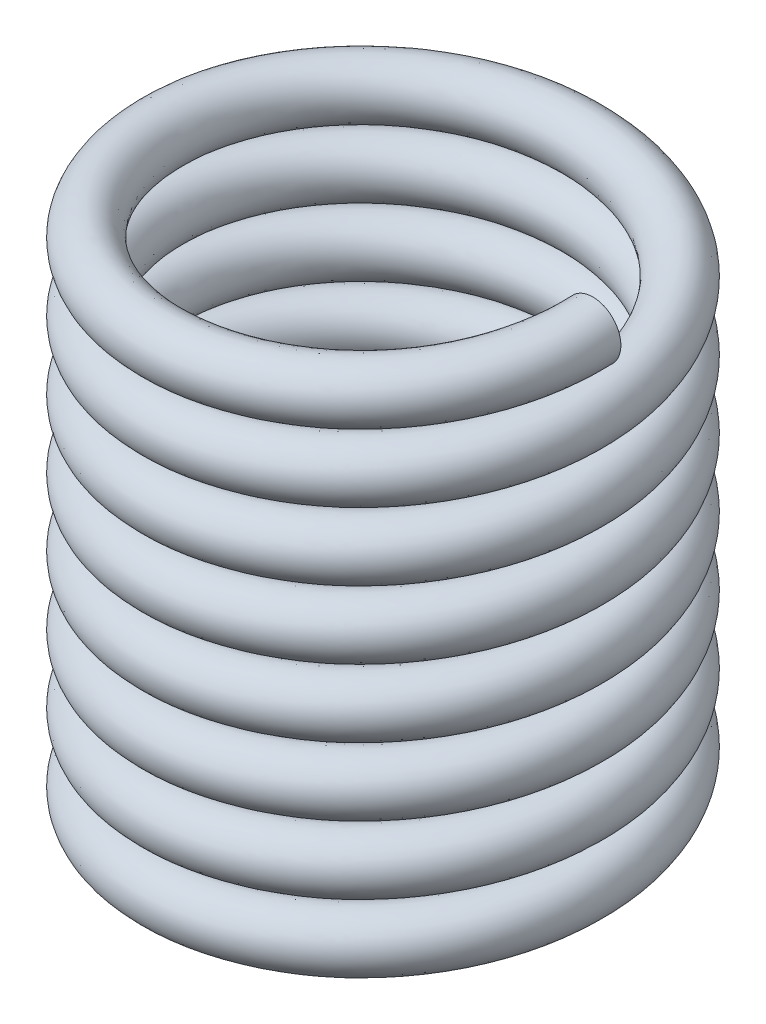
ISO-10303-21;
HEADER;
FILE_DESCRIPTION(('STEP AP214'),'2;1');
FILE_NAME('part.step','',(''),(''),'','','');
FILE_SCHEMA(('AUTOMOTIVE_DESIGN { 1 0 10303 214 1 1 1 1 }'));
ENDSEC;
DATA;
#1=APPLICATION_CONTEXT('core data for automotive mechanical design processes');
#2=APPLICATION_PROTOCOL_DEFINITION('international standard','automotive_design',2000,#1);
#3=PRODUCT_CONTEXT('',#1,'mechanical');
#4=PRODUCT('Part','Part','',(#3));
#5=PRODUCT_RELATED_PRODUCT_CATEGORY('part','',(#4));
#6=PRODUCT_DEFINITION_FORMATION('','',#4);
#7=PRODUCT_DEFINITION_CONTEXT('part definition',#1,'design');
#8=PRODUCT_DEFINITION('design','',#6,#7);
#9=PRODUCT_DEFINITION_SHAPE('','',#8);
#10=(LENGTH_UNIT() NAMED_UNIT(*) SI_UNIT(.MILLI.,.METRE.));
#11=(NAMED_UNIT(*) PLANE_ANGLE_UNIT() SI_UNIT($,.RADIAN.));
#12=(NAMED_UNIT(*) SI_UNIT($,.STERADIAN.) SOLID_ANGLE_UNIT());
#13=UNCERTAINTY_MEASURE_WITH_UNIT(LENGTH_MEASURE(1.E-05),#10,'distance_accuracy_value','');
#14=(GEOMETRIC_REPRESENTATION_CONTEXT(3) GLOBAL_UNCERTAINTY_ASSIGNED_CONTEXT((#13)) GLOBAL_UNIT_ASSIGNED_CONTEXT((#10,
#11,#12)) REPRESENTATION_CONTEXT('',''));
#15=CARTESIAN_POINT('',(0.,0.,0.));
#16=DIRECTION('',(0.,0.,1.));
#17=DIRECTION('',(1.,0.,0.));
#18=AXIS2_PLACEMENT_3D('',#15,#16,#17);
#19=CARTESIAN_POINT('',(-7.5,0.,0.));
#20=DIRECTION('',(0.,0.,1.));
#21=DIRECTION('',(1.,0.,0.));
#22=AXIS2_PLACEMENT_3D('',#19,#20,#21);
#23=PLANE('',#22);
#24=CARTESIAN_POINT('',(-7.5,0.,0.));
#25=DIRECTION('',(0.,0.,1.));
#26=DIRECTION('',(1.,0.,0.));
#27=AXIS2_PLACEMENT_3D('',#24,#25,#26);
#28=CIRCLE('',#27,1.);
#29=CARTESIAN_POINT('',(-6.5,0.,0.));
#30=VERTEX_POINT('',#29);
#31=EDGE_CURVE('E49',#30,#30,#28,.T.);
#32=ORIENTED_EDGE('',*,*,#31,.F.);
#33=EDGE_LOOP('',(#32));
#34=FACE_BOUND('',#33,.T.);
#35=ADVANCED_FACE('F43',(#34),#23,.F.);
#36=CARTESIAN_POINT('',(7.5,18.1926992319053,-8.12228653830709E-13));
#37=DIRECTION('',(-1.08297153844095E-13,0.,-1.));
#38=DIRECTION('',(-1.,0.,1.08297153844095E-13));
#39=AXIS2_PLACEMENT_3D('',#36,#37,#38);
#40=PLANE('',#39);
#41=CARTESIAN_POINT('',(7.5,18.1926992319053,-8.12228653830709E-13));
#42=DIRECTION('',(-1.08297153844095E-13,0.,-1.));
#43=DIRECTION('',(-1.,0.,1.08297153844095E-13));
#44=AXIS2_PLACEMENT_3D('',#41,#42,#43);
#45=CIRCLE('',#44,1.);
#46=CARTESIAN_POINT('',(6.5,18.1926992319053,-7.03931499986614E-13));
#47=VERTEX_POINT('',#46);
#48=EDGE_CURVE('E10',#47,#47,#45,.T.);
#49=ORIENTED_EDGE('',*,*,#48,.T.);
#50=EDGE_LOOP('',(#49));
#51=FACE_BOUND('',#50,.T.);
#52=ADVANCED_FACE('F58',(#51),#40,.T.);
#53=CARTESIAN_POINT('',(-6.5,0.,0.));
#54=CARTESIAN_POINT('',(-6.5,0.202141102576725,3.75277674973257));
#55=CARTESIAN_POINT('',(-3.25,0.404282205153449,5.62916512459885));
#56=CARTESIAN_POINT('',(0.,0.606423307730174,7.50555349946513));
#57=CARTESIAN_POINT('',(3.25,0.808564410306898,5.62916512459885));
#58=CARTESIAN_POINT('',(6.5,1.01070551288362,3.75277674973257));
#59=CARTESIAN_POINT('',(6.5,1.21284661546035,0.));
#60=CARTESIAN_POINT('',(6.5,1.41498771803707,-3.75277674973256));
#61=CARTESIAN_POINT('',(3.25,1.6171288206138,-5.62916512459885));
#62=CARTESIAN_POINT('',(0.,1.81926992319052,-7.50555349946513));
#63=CARTESIAN_POINT('',(-3.25,2.02141102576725,-5.62916512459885));
#64=CARTESIAN_POINT('',(-6.5,2.22355212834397,-3.75277674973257));
#65=CARTESIAN_POINT('',(-6.5,2.42569323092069,0.));
#66=CARTESIAN_POINT('',(-6.5,2.62783433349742,3.75277674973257));
#67=CARTESIAN_POINT('',(-3.25,2.82997543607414,5.62916512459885));
#68=CARTESIAN_POINT('',(0.,3.03211653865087,7.50555349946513));
#69=CARTESIAN_POINT('',(3.25,3.23425764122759,5.62916512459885));
#70=CARTESIAN_POINT('',(6.5,3.43639874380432,3.75277674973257));
#71=CARTESIAN_POINT('',(6.5,3.63853984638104,0.));
#72=CARTESIAN_POINT('',(6.5,3.84068094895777,-3.75277674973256));
#73=CARTESIAN_POINT('',(3.25,4.04282205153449,-5.62916512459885));
#74=CARTESIAN_POINT('',(0.,4.24496315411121,-7.50555349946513));
#75=CARTESIAN_POINT('',(-3.25,4.44710425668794,-5.62916512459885));
#76=CARTESIAN_POINT('',(-6.5,4.64924535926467,-3.75277674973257));
#77=CARTESIAN_POINT('',(-6.5,4.85138646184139,0.));
#78=CARTESIAN_POINT('',(-6.5,5.05352756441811,3.75277674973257));
#79=CARTESIAN_POINT('',(-3.25,5.25566866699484,5.62916512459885));
#80=CARTESIAN_POINT('',(0.,5.45780976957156,7.50555349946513));
#81=CARTESIAN_POINT('',(3.25,5.65995087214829,5.62916512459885));
#82=CARTESIAN_POINT('',(6.5,5.86209197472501,3.75277674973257));
#83=CARTESIAN_POINT('',(6.5,6.06423307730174,0.));
#84=CARTESIAN_POINT('',(6.5,6.26637417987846,-3.75277674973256));
#85=CARTESIAN_POINT('',(3.25,6.46851528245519,-5.62916512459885));
#86=CARTESIAN_POINT('',(0.,6.67065638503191,-7.50555349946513));
#87=CARTESIAN_POINT('',(-3.25,6.87279748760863,-5.62916512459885));
#88=CARTESIAN_POINT('',(-6.5,7.07493859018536,-3.75277674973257));
#89=CARTESIAN_POINT('',(-6.5,7.27707969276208,0.));
#90=CARTESIAN_POINT('',(-6.5,7.47922079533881,3.75277674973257));
#91=CARTESIAN_POINT('',(-3.25,7.68136189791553,5.62916512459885));
#92=CARTESIAN_POINT('',(0.,7.88350300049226,7.50555349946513));
#93=CARTESIAN_POINT('',(3.25,8.08564410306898,5.62916512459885));
#94=CARTESIAN_POINT('',(6.5,8.28778520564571,3.75277674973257));
#95=CARTESIAN_POINT('',(6.5,8.48992630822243,0.));
#96=CARTESIAN_POINT('',(6.5,8.69206741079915,-3.75277674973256));
#97=CARTESIAN_POINT('',(3.25,8.89420851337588,-5.62916512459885));
#98=CARTESIAN_POINT('',(0.,9.0963496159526,-7.50555349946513));
#99=CARTESIAN_POINT('',(-3.25,9.29849071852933,-5.62916512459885));
#100=CARTESIAN_POINT('',(-6.5,9.50063182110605,-3.75277674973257));
#101=CARTESIAN_POINT('',(-6.5,9.70277292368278,0.));
#102=CARTESIAN_POINT('',(-6.5,9.9049140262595,3.75277674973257));
#103=CARTESIAN_POINT('',(-3.25,10.1070551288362,5.62916512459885));
#104=CARTESIAN_POINT('',(0.,10.309196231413,7.50555349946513));
#105=CARTESIAN_POINT('',(3.25,10.5113373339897,5.62916512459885));
#106=CARTESIAN_POINT('',(6.5,10.7134784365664,3.75277674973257));
#107=CARTESIAN_POINT('',(6.5,10.9156195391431,0.));
#108=CARTESIAN_POINT('',(6.5,11.1177606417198,-3.75277674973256));
#109=CARTESIAN_POINT('',(3.25,11.3199017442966,-5.62916512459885));
#110=CARTESIAN_POINT('',(0.,11.5220428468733,-7.50555349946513));
#111=CARTESIAN_POINT('',(-3.25,11.72418394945,-5.62916512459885));
#112=CARTESIAN_POINT('',(-6.5,11.9263250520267,-3.75277674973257));
#113=CARTESIAN_POINT('',(-6.5,12.1284661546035,0.));
#114=CARTESIAN_POINT('',(-6.5,12.3306072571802,3.75277674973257));
#115=CARTESIAN_POINT('',(-3.25,12.5327483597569,5.62916512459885));
#116=CARTESIAN_POINT('',(0.,12.7348894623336,7.50555349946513));
#117=CARTESIAN_POINT('',(3.25,12.9370305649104,5.62916512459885));
#118=CARTESIAN_POINT('',(6.5,13.1391716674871,3.75277674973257));
#119=CARTESIAN_POINT('',(6.5,13.3413127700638,0.));
#120=CARTESIAN_POINT('',(6.5,13.5434538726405,-3.75277674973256));
#121=CARTESIAN_POINT('',(3.25,13.7455949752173,-5.62916512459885));
#122=CARTESIAN_POINT('',(0.,13.947736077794,-7.50555349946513));
#123=CARTESIAN_POINT('',(-3.25,14.1498771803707,-5.62916512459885));
#124=CARTESIAN_POINT('',(-6.5,14.3520182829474,-3.75277674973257));
#125=CARTESIAN_POINT('',(-6.5,14.5541593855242,0.));
#126=CARTESIAN_POINT('',(-6.5,14.7563004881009,3.75277674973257));
#127=CARTESIAN_POINT('',(-3.25,14.9584415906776,5.62916512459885));
#128=CARTESIAN_POINT('',(0.,15.1605826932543,7.50555349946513));
#129=CARTESIAN_POINT('',(3.25,15.3627237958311,5.62916512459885));
#130=CARTESIAN_POINT('',(6.5,15.5648648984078,3.75277674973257));
#131=CARTESIAN_POINT('',(6.5,15.7670060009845,0.));
#132=CARTESIAN_POINT('',(6.5,15.9691471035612,-3.75277674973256));
#133=CARTESIAN_POINT('',(3.25,16.171288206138,-5.62916512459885));
#134=CARTESIAN_POINT('',(0.,16.3734293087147,-7.50555349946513));
#135=CARTESIAN_POINT('',(-3.25,16.5755704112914,-5.62916512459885));
#136=CARTESIAN_POINT('',(-6.5,16.7777115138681,-3.75277674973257));
#137=CARTESIAN_POINT('',(-6.5,16.9798526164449,0.));
#138=CARTESIAN_POINT('',(-6.5,17.1819937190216,3.75277674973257));
#139=CARTESIAN_POINT('',(-3.25,17.3841348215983,5.62916512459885));
#140=CARTESIAN_POINT('',(0.,17.586275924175,7.50555349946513));
#141=CARTESIAN_POINT('',(3.25,17.7884170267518,5.62916512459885));
#142=CARTESIAN_POINT('',(6.5,17.9905581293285,3.75277674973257));
#143=CARTESIAN_POINT('',(6.5,18.1926992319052,0.));
#144=CARTESIAN_POINT('',(6.5,18.3948403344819,-3.75277674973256));
#145=CARTESIAN_POINT('',(3.25,18.5969814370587,-5.62916512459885));
#146=CARTESIAN_POINT('',(0.,18.7991225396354,-7.50555349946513));
#147=CARTESIAN_POINT('',(-3.25,19.0012636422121,-5.62916512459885));
#148=CARTESIAN_POINT('',(-6.5,19.2034047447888,-3.75277674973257));
#149=CARTESIAN_POINT('',(-6.5,19.4055458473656,0.));
#150=CARTESIAN_POINT('',(-6.5,2.,0.));
#151=CARTESIAN_POINT('',(-6.5,2.20214110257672,3.75277674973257));
#152=CARTESIAN_POINT('',(-3.25,2.40428220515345,5.62916512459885));
#153=CARTESIAN_POINT('',(0.,2.60642330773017,7.50555349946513));
#154=CARTESIAN_POINT('',(3.25,2.8085644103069,5.62916512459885));
#155=CARTESIAN_POINT('',(6.5,3.01070551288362,3.75277674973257));
#156=CARTESIAN_POINT('',(6.5,3.21284661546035,0.));
#157=CARTESIAN_POINT('',(6.5,3.41498771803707,-3.75277674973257));
#158=CARTESIAN_POINT('',(3.25,3.6171288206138,-5.62916512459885));
#159=CARTESIAN_POINT('',(0.,3.81926992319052,-7.50555349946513));
#160=CARTESIAN_POINT('',(-3.25,4.02141102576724,-5.62916512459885));
#161=CARTESIAN_POINT('',(-6.5,4.22355212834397,-3.75277674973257));
#162=CARTESIAN_POINT('',(-6.5,4.42569323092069,0.));
#163=CARTESIAN_POINT('',(-6.5,4.62783433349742,3.75277674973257));
#164=CARTESIAN_POINT('',(-3.25,4.82997543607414,5.62916512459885));
#165=CARTESIAN_POINT('',(0.,5.03211653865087,7.50555349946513));
#166=CARTESIAN_POINT('',(3.25,5.23425764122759,5.62916512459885));
#167=CARTESIAN_POINT('',(6.5,5.43639874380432,3.75277674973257));
#168=CARTESIAN_POINT('',(6.5,5.63853984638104,0.));
#169=CARTESIAN_POINT('',(6.5,5.84068094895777,-3.75277674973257));
#170=CARTESIAN_POINT('',(3.25,6.04282205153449,-5.62916512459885));
#171=CARTESIAN_POINT('',(0.,6.24496315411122,-7.50555349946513));
#172=CARTESIAN_POINT('',(-3.25,6.44710425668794,-5.62916512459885));
#173=CARTESIAN_POINT('',(-6.5,6.64924535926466,-3.75277674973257));
#174=CARTESIAN_POINT('',(-6.5,6.85138646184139,0.));
#175=CARTESIAN_POINT('',(-6.5,7.05352756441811,3.75277674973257));
#176=CARTESIAN_POINT('',(-3.25,7.25566866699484,5.62916512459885));
#177=CARTESIAN_POINT('',(0.,7.45780976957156,7.50555349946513));
#178=CARTESIAN_POINT('',(3.25,7.65995087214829,5.62916512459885));
#179=CARTESIAN_POINT('',(6.5,7.86209197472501,3.75277674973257));
#180=CARTESIAN_POINT('',(6.5,8.06423307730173,0.));
#181=CARTESIAN_POINT('',(6.5,8.26637417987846,-3.75277674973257));
#182=CARTESIAN_POINT('',(3.25,8.46851528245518,-5.62916512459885));
#183=CARTESIAN_POINT('',(0.,8.67065638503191,-7.50555349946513));
#184=CARTESIAN_POINT('',(-3.25,8.87279748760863,-5.62916512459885));
#185=CARTESIAN_POINT('',(-6.5,9.07493859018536,-3.75277674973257));
#186=CARTESIAN_POINT('',(-6.5,9.27707969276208,0.));
#187=CARTESIAN_POINT('',(-6.5,9.47922079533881,3.75277674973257));
#188=CARTESIAN_POINT('',(-3.25,9.68136189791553,5.62916512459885));
#189=CARTESIAN_POINT('',(0.,9.88350300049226,7.50555349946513));
#190=CARTESIAN_POINT('',(3.25,10.085644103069,5.62916512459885));
#191=CARTESIAN_POINT('',(6.5,10.2877852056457,3.75277674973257));
#192=CARTESIAN_POINT('',(6.5,10.4899263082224,0.));
#193=CARTESIAN_POINT('',(6.5,10.6920674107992,-3.75277674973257));
#194=CARTESIAN_POINT('',(3.25,10.8942085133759,-5.62916512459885));
#195=CARTESIAN_POINT('',(0.,11.0963496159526,-7.50555349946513));
#196=CARTESIAN_POINT('',(-3.25,11.2984907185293,-5.62916512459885));
#197=CARTESIAN_POINT('',(-6.5,11.5006318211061,-3.75277674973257));
#198=CARTESIAN_POINT('',(-6.5,11.7027729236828,0.));
#199=CARTESIAN_POINT('',(-6.5,11.9049140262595,3.75277674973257));
#200=CARTESIAN_POINT('',(-3.25,12.1070551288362,5.62916512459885));
#201=CARTESIAN_POINT('',(0.,12.309196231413,7.50555349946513));
#202=CARTESIAN_POINT('',(3.25,12.5113373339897,5.62916512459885));
#203=CARTESIAN_POINT('',(6.5,12.7134784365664,3.75277674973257));
#204=CARTESIAN_POINT('',(6.5,12.9156195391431,0.));
#205=CARTESIAN_POINT('',(6.5,13.1177606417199,-3.75277674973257));
#206=CARTESIAN_POINT('',(3.25,13.3199017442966,-5.62916512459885));
#207=CARTESIAN_POINT('',(0.,13.5220428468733,-7.50555349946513));
#208=CARTESIAN_POINT('',(-3.25,13.72418394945,-5.62916512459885));
#209=CARTESIAN_POINT('',(-6.5,13.9263250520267,-3.75277674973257));
#210=CARTESIAN_POINT('',(-6.5,14.1284661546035,0.));
#211=CARTESIAN_POINT('',(-6.5,14.3306072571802,3.75277674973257));
#212=CARTESIAN_POINT('',(-3.25,14.5327483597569,5.62916512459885));
#213=CARTESIAN_POINT('',(0.,14.7348894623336,7.50555349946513));
#214=CARTESIAN_POINT('',(3.25,14.9370305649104,5.62916512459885));
#215=CARTESIAN_POINT('',(6.5,15.1391716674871,3.75277674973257));
#216=CARTESIAN_POINT('',(6.5,15.3413127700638,0.));
#217=CARTESIAN_POINT('',(6.5,15.5434538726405,-3.75277674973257));
#218=CARTESIAN_POINT('',(3.25,15.7455949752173,-5.62916512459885));
#219=CARTESIAN_POINT('',(0.,15.947736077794,-7.50555349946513));
#220=CARTESIAN_POINT('',(-3.25,16.1498771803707,-5.62916512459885));
#221=CARTESIAN_POINT('',(-6.5,16.3520182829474,-3.75277674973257));
#222=CARTESIAN_POINT('',(-6.5,16.5541593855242,0.));
#223=CARTESIAN_POINT('',(-6.5,16.7563004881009,3.75277674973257));
#224=CARTESIAN_POINT('',(-3.25,16.9584415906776,5.62916512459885));
#225=CARTESIAN_POINT('',(0.,17.1605826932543,7.50555349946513));
#226=CARTESIAN_POINT('',(3.25,17.3627237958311,5.62916512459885));
#227=CARTESIAN_POINT('',(6.5,17.5648648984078,3.75277674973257));
#228=CARTESIAN_POINT('',(6.5,17.7670060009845,0.));
#229=CARTESIAN_POINT('',(6.5,17.9691471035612,-3.75277674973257));
#230=CARTESIAN_POINT('',(3.25,18.171288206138,-5.62916512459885));
#231=CARTESIAN_POINT('',(0.,18.3734293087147,-7.50555349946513));
#232=CARTESIAN_POINT('',(-3.25,18.5755704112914,-5.62916512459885));
#233=CARTESIAN_POINT('',(-6.5,18.7777115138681,-3.75277674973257));
#234=CARTESIAN_POINT('',(-6.5,18.9798526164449,0.));
#235=CARTESIAN_POINT('',(-6.5,19.1819937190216,3.75277674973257));
#236=CARTESIAN_POINT('',(-3.25,19.3841348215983,5.62916512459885));
#237=CARTESIAN_POINT('',(0.,19.586275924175,7.50555349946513));
#238=CARTESIAN_POINT('',(3.25,19.7884170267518,5.62916512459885));
#239=CARTESIAN_POINT('',(6.5,19.9905581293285,3.75277674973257));
#240=CARTESIAN_POINT('',(6.5,20.1926992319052,0.));
#241=CARTESIAN_POINT('',(6.5,20.3948403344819,-3.75277674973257));
#242=CARTESIAN_POINT('',(3.25,20.5969814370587,-5.62916512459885));
#243=CARTESIAN_POINT('',(0.,20.7991225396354,-7.50555349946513));
#244=CARTESIAN_POINT('',(-3.25,21.0012636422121,-5.62916512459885));
#245=CARTESIAN_POINT('',(-6.5,21.2034047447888,-3.75277674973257));
#246=CARTESIAN_POINT('',(-6.5,21.4055458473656,0.));
#247=CARTESIAN_POINT('',(-8.5,2.,0.));
#248=CARTESIAN_POINT('',(-8.5,2.20214110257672,4.90747728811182));
#249=CARTESIAN_POINT('',(-4.25,2.40428220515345,7.36121593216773));
#250=CARTESIAN_POINT('',(0.,2.60642330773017,9.81495457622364));
#251=CARTESIAN_POINT('',(4.25,2.8085644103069,7.36121593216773));
#252=CARTESIAN_POINT('',(8.5,3.01070551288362,4.90747728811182));
#253=CARTESIAN_POINT('',(8.5,3.21284661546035,0.));
#254=CARTESIAN_POINT('',(8.5,3.41498771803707,-4.90747728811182));
#255=CARTESIAN_POINT('',(4.25,3.6171288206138,-7.36121593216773));
#256=CARTESIAN_POINT('',(0.,3.81926992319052,-9.81495457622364));
#257=CARTESIAN_POINT('',(-4.24999999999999,4.02141102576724,-7.36121593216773));
#258=CARTESIAN_POINT('',(-8.5,4.22355212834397,-4.90747728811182));
#259=CARTESIAN_POINT('',(-8.5,4.42569323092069,0.));
#260=CARTESIAN_POINT('',(-8.5,4.62783433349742,4.90747728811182));
#261=CARTESIAN_POINT('',(-4.25,4.82997543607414,7.36121593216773));
#262=CARTESIAN_POINT('',(0.,5.03211653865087,9.81495457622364));
#263=CARTESIAN_POINT('',(4.25,5.23425764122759,7.36121593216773));
#264=CARTESIAN_POINT('',(8.5,5.43639874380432,4.90747728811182));
#265=CARTESIAN_POINT('',(8.5,5.63853984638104,0.));
#266=CARTESIAN_POINT('',(8.5,5.84068094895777,-4.90747728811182));
#267=CARTESIAN_POINT('',(4.25,6.04282205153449,-7.36121593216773));
#268=CARTESIAN_POINT('',(0.,6.24496315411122,-9.81495457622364));
#269=CARTESIAN_POINT('',(-4.24999999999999,6.44710425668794,-7.36121593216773));
#270=CARTESIAN_POINT('',(-8.5,6.64924535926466,-4.90747728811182));
#271=CARTESIAN_POINT('',(-8.5,6.85138646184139,0.));
#272=CARTESIAN_POINT('',(-8.5,7.05352756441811,4.90747728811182));
#273=CARTESIAN_POINT('',(-4.25,7.25566866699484,7.36121593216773));
#274=CARTESIAN_POINT('',(0.,7.45780976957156,9.81495457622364));
#275=CARTESIAN_POINT('',(4.25,7.65995087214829,7.36121593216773));
#276=CARTESIAN_POINT('',(8.5,7.86209197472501,4.90747728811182));
#277=CARTESIAN_POINT('',(8.5,8.06423307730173,0.));
#278=CARTESIAN_POINT('',(8.5,8.26637417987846,-4.90747728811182));
#279=CARTESIAN_POINT('',(4.25,8.46851528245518,-7.36121593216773));
#280=CARTESIAN_POINT('',(0.,8.67065638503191,-9.81495457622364));
#281=CARTESIAN_POINT('',(-4.24999999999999,8.87279748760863,-7.36121593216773));
#282=CARTESIAN_POINT('',(-8.5,9.07493859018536,-4.90747728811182));
#283=CARTESIAN_POINT('',(-8.5,9.27707969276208,0.));
#284=CARTESIAN_POINT('',(-8.5,9.47922079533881,4.90747728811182));
#285=CARTESIAN_POINT('',(-4.25,9.68136189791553,7.36121593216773));
#286=CARTESIAN_POINT('',(0.,9.88350300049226,9.81495457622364));
#287=CARTESIAN_POINT('',(4.25,10.085644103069,7.36121593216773));
#288=CARTESIAN_POINT('',(8.5,10.2877852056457,4.90747728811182));
#289=CARTESIAN_POINT('',(8.5,10.4899263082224,0.));
#290=CARTESIAN_POINT('',(8.5,10.6920674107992,-4.90747728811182));
#291=CARTESIAN_POINT('',(4.25,10.8942085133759,-7.36121593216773));
#292=CARTESIAN_POINT('',(0.,11.0963496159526,-9.81495457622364));
#293=CARTESIAN_POINT('',(-4.24999999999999,11.2984907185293,-7.36121593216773));
#294=CARTESIAN_POINT('',(-8.5,11.5006318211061,-4.90747728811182));
#295=CARTESIAN_POINT('',(-8.5,11.7027729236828,0.));
#296=CARTESIAN_POINT('',(-8.5,11.9049140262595,4.90747728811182));
#297=CARTESIAN_POINT('',(-4.25,12.1070551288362,7.36121593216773));
#298=CARTESIAN_POINT('',(0.,12.309196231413,9.81495457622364));
#299=CARTESIAN_POINT('',(4.25,12.5113373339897,7.36121593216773));
#300=CARTESIAN_POINT('',(8.5,12.7134784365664,4.90747728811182));
#301=CARTESIAN_POINT('',(8.5,12.9156195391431,0.));
#302=CARTESIAN_POINT('',(8.5,13.1177606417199,-4.90747728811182));
#303=CARTESIAN_POINT('',(4.25,13.3199017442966,-7.36121593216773));
#304=CARTESIAN_POINT('',(0.,13.5220428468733,-9.81495457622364));
#305=CARTESIAN_POINT('',(-4.24999999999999,13.72418394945,-7.36121593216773));
#306=CARTESIAN_POINT('',(-8.5,13.9263250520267,-4.90747728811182));
#307=CARTESIAN_POINT('',(-8.5,14.1284661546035,0.));
#308=CARTESIAN_POINT('',(-8.5,14.3306072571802,4.90747728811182));
#309=CARTESIAN_POINT('',(-4.25,14.5327483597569,7.36121593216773));
#310=CARTESIAN_POINT('',(0.,14.7348894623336,9.81495457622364));
#311=CARTESIAN_POINT('',(4.25,14.9370305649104,7.36121593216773));
#312=CARTESIAN_POINT('',(8.5,15.1391716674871,4.90747728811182));
#313=CARTESIAN_POINT('',(8.5,15.3413127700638,0.));
#314=CARTESIAN_POINT('',(8.5,15.5434538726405,-4.90747728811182));
#315=CARTESIAN_POINT('',(4.25,15.7455949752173,-7.36121593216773));
#316=CARTESIAN_POINT('',(0.,15.947736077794,-9.81495457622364));
#317=CARTESIAN_POINT('',(-4.24999999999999,16.1498771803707,-7.36121593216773));
#318=CARTESIAN_POINT('',(-8.5,16.3520182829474,-4.90747728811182));
#319=CARTESIAN_POINT('',(-8.5,16.5541593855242,0.));
#320=CARTESIAN_POINT('',(-8.5,16.7563004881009,4.90747728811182));
#321=CARTESIAN_POINT('',(-4.25,16.9584415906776,7.36121593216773));
#322=CARTESIAN_POINT('',(0.,17.1605826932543,9.81495457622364));
#323=CARTESIAN_POINT('',(4.25,17.3627237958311,7.36121593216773));
#324=CARTESIAN_POINT('',(8.5,17.5648648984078,4.90747728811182));
#325=CARTESIAN_POINT('',(8.5,17.7670060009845,0.));
#326=CARTESIAN_POINT('',(8.5,17.9691471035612,-4.90747728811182));
#327=CARTESIAN_POINT('',(4.25,18.171288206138,-7.36121593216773));
#328=CARTESIAN_POINT('',(0.,18.3734293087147,-9.81495457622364));
#329=CARTESIAN_POINT('',(-4.24999999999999,18.5755704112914,-7.36121593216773));
#330=CARTESIAN_POINT('',(-8.5,18.7777115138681,-4.90747728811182));
#331=CARTESIAN_POINT('',(-8.5,18.9798526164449,0.));
#332=CARTESIAN_POINT('',(-8.5,19.1819937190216,4.90747728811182));
#333=CARTESIAN_POINT('',(-4.25,19.3841348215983,7.36121593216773));
#334=CARTESIAN_POINT('',(0.,19.586275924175,9.81495457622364));
#335=CARTESIAN_POINT('',(4.25,19.7884170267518,7.36121593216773));
#336=CARTESIAN_POINT('',(8.5,19.9905581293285,4.90747728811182));
#337=CARTESIAN_POINT('',(8.5,20.1926992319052,0.));
#338=CARTESIAN_POINT('',(8.5,20.3948403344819,-4.90747728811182));
#339=CARTESIAN_POINT('',(4.25,20.5969814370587,-7.36121593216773));
#340=CARTESIAN_POINT('',(0.,20.7991225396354,-9.81495457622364));
#341=CARTESIAN_POINT('',(-4.24999999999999,21.0012636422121,-7.36121593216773));
#342=CARTESIAN_POINT('',(-8.5,21.2034047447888,-4.90747728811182));
#343=CARTESIAN_POINT('',(-8.5,21.4055458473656,0.));
#344=CARTESIAN_POINT('',(-8.5,0.,0.));
#345=CARTESIAN_POINT('',(-8.5,0.202141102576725,4.90747728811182));
#346=CARTESIAN_POINT('',(-4.25,0.404282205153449,7.36121593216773));
#347=CARTESIAN_POINT('',(0.,0.606423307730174,9.81495457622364));
#348=CARTESIAN_POINT('',(4.25,0.808564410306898,7.36121593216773));
#349=CARTESIAN_POINT('',(8.5,1.01070551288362,4.90747728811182));
#350=CARTESIAN_POINT('',(8.5,1.21284661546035,0.));
#351=CARTESIAN_POINT('',(8.5,1.41498771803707,-4.90747728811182));
#352=CARTESIAN_POINT('',(4.25,1.6171288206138,-7.36121593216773));
#353=CARTESIAN_POINT('',(0.,1.81926992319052,-9.81495457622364));
#354=CARTESIAN_POINT('',(-4.24999999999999,2.02141102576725,-7.36121593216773));
#355=CARTESIAN_POINT('',(-8.49999999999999,2.22355212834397,-4.90747728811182));
#356=CARTESIAN_POINT('',(-8.5,2.42569323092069,0.));
#357=CARTESIAN_POINT('',(-8.5,2.62783433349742,4.90747728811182));
#358=CARTESIAN_POINT('',(-4.25,2.82997543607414,7.36121593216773));
#359=CARTESIAN_POINT('',(0.,3.03211653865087,9.81495457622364));
#360=CARTESIAN_POINT('',(4.25,3.23425764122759,7.36121593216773));
#361=CARTESIAN_POINT('',(8.5,3.43639874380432,4.90747728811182));
#362=CARTESIAN_POINT('',(8.5,3.63853984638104,0.));
#363=CARTESIAN_POINT('',(8.5,3.84068094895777,-4.90747728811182));
#364=CARTESIAN_POINT('',(4.25,4.04282205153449,-7.36121593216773));
#365=CARTESIAN_POINT('',(0.,4.24496315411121,-9.81495457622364));
#366=CARTESIAN_POINT('',(-4.24999999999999,4.44710425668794,-7.36121593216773));
#367=CARTESIAN_POINT('',(-8.49999999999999,4.64924535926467,-4.90747728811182));
#368=CARTESIAN_POINT('',(-8.5,4.85138646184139,0.));
#369=CARTESIAN_POINT('',(-8.5,5.05352756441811,4.90747728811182));
#370=CARTESIAN_POINT('',(-4.25,5.25566866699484,7.36121593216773));
#371=CARTESIAN_POINT('',(0.,5.45780976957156,9.81495457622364));
#372=CARTESIAN_POINT('',(4.25,5.65995087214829,7.36121593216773));
#373=CARTESIAN_POINT('',(8.5,5.86209197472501,4.90747728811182));
#374=CARTESIAN_POINT('',(8.5,6.06423307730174,0.));
#375=CARTESIAN_POINT('',(8.5,6.26637417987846,-4.90747728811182));
#376=CARTESIAN_POINT('',(4.25,6.46851528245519,-7.36121593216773));
#377=CARTESIAN_POINT('',(0.,6.67065638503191,-9.81495457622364));
#378=CARTESIAN_POINT('',(-4.24999999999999,6.87279748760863,-7.36121593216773));
#379=CARTESIAN_POINT('',(-8.49999999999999,7.07493859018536,-4.90747728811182));
#380=CARTESIAN_POINT('',(-8.5,7.27707969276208,0.));
#381=CARTESIAN_POINT('',(-8.5,7.47922079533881,4.90747728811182));
#382=CARTESIAN_POINT('',(-4.25,7.68136189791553,7.36121593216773));
#383=CARTESIAN_POINT('',(0.,7.88350300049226,9.81495457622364));
#384=CARTESIAN_POINT('',(4.25,8.08564410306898,7.36121593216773));
#385=CARTESIAN_POINT('',(8.5,8.28778520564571,4.90747728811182));
#386=CARTESIAN_POINT('',(8.5,8.48992630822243,0.));
#387=CARTESIAN_POINT('',(8.5,8.69206741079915,-4.90747728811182));
#388=CARTESIAN_POINT('',(4.25,8.89420851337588,-7.36121593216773));
#389=CARTESIAN_POINT('',(0.,9.0963496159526,-9.81495457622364));
#390=CARTESIAN_POINT('',(-4.24999999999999,9.29849071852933,-7.36121593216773));
#391=CARTESIAN_POINT('',(-8.49999999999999,9.50063182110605,-4.90747728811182));
#392=CARTESIAN_POINT('',(-8.5,9.70277292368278,0.));
#393=CARTESIAN_POINT('',(-8.5,9.9049140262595,4.90747728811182));
#394=CARTESIAN_POINT('',(-4.25,10.1070551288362,7.36121593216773));
#395=CARTESIAN_POINT('',(0.,10.309196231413,9.81495457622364));
#396=CARTESIAN_POINT('',(4.25,10.5113373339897,7.36121593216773));
#397=CARTESIAN_POINT('',(8.5,10.7134784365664,4.90747728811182));
#398=CARTESIAN_POINT('',(8.5,10.9156195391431,0.));
#399=CARTESIAN_POINT('',(8.5,11.1177606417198,-4.90747728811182));
#400=CARTESIAN_POINT('',(4.25,11.3199017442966,-7.36121593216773));
#401=CARTESIAN_POINT('',(0.,11.5220428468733,-9.81495457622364));
#402=CARTESIAN_POINT('',(-4.24999999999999,11.72418394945,-7.36121593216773));
#403=CARTESIAN_POINT('',(-8.49999999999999,11.9263250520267,-4.90747728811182));
#404=CARTESIAN_POINT('',(-8.5,12.1284661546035,0.));
#405=CARTESIAN_POINT('',(-8.5,12.3306072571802,4.90747728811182));
#406=CARTESIAN_POINT('',(-4.25,12.5327483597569,7.36121593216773));
#407=CARTESIAN_POINT('',(0.,12.7348894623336,9.81495457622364));
#408=CARTESIAN_POINT('',(4.25,12.9370305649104,7.36121593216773));
#409=CARTESIAN_POINT('',(8.5,13.1391716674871,4.90747728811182));
#410=CARTESIAN_POINT('',(8.5,13.3413127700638,0.));
#411=CARTESIAN_POINT('',(8.5,13.5434538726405,-4.90747728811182));
#412=CARTESIAN_POINT('',(4.25,13.7455949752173,-7.36121593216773));
#413=CARTESIAN_POINT('',(0.,13.947736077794,-9.81495457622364));
#414=CARTESIAN_POINT('',(-4.24999999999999,14.1498771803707,-7.36121593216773));
#415=CARTESIAN_POINT('',(-8.49999999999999,14.3520182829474,-4.90747728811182));
#416=CARTESIAN_POINT('',(-8.5,14.5541593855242,0.));
#417=CARTESIAN_POINT('',(-8.5,14.7563004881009,4.90747728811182));
#418=CARTESIAN_POINT('',(-4.25,14.9584415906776,7.36121593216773));
#419=CARTESIAN_POINT('',(0.,15.1605826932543,9.81495457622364));
#420=CARTESIAN_POINT('',(4.25,15.3627237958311,7.36121593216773));
#421=CARTESIAN_POINT('',(8.5,15.5648648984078,4.90747728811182));
#422=CARTESIAN_POINT('',(8.5,15.7670060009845,0.));
#423=CARTESIAN_POINT('',(8.5,15.9691471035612,-4.90747728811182));
#424=CARTESIAN_POINT('',(4.25,16.171288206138,-7.36121593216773));
#425=CARTESIAN_POINT('',(0.,16.3734293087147,-9.81495457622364));
#426=CARTESIAN_POINT('',(-4.24999999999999,16.5755704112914,-7.36121593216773));
#427=CARTESIAN_POINT('',(-8.49999999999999,16.7777115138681,-4.90747728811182));
#428=CARTESIAN_POINT('',(-8.5,16.9798526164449,0.));
#429=CARTESIAN_POINT('',(-8.5,17.1819937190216,4.90747728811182));
#430=CARTESIAN_POINT('',(-4.25,17.3841348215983,7.36121593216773));
#431=CARTESIAN_POINT('',(0.,17.586275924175,9.81495457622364));
#432=CARTESIAN_POINT('',(4.25,17.7884170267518,7.36121593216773));
#433=CARTESIAN_POINT('',(8.5,17.9905581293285,4.90747728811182));
#434=CARTESIAN_POINT('',(8.5,18.1926992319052,0.));
#435=CARTESIAN_POINT('',(8.5,18.3948403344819,-4.90747728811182));
#436=CARTESIAN_POINT('',(4.25,18.5969814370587,-7.36121593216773));
#437=CARTESIAN_POINT('',(0.,18.7991225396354,-9.81495457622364));
#438=CARTESIAN_POINT('',(-4.24999999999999,19.0012636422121,-7.36121593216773));
#439=CARTESIAN_POINT('',(-8.49999999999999,19.2034047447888,-4.90747728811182));
#440=CARTESIAN_POINT('',(-8.5,19.4055458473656,0.));
#441=CARTESIAN_POINT('',(-8.5,-2.,0.));
#442=CARTESIAN_POINT('',(-8.5,-1.79785889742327,4.90747728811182));
#443=CARTESIAN_POINT('',(-4.25,-1.59571779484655,7.36121593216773));
#444=CARTESIAN_POINT('',(0.,-1.39357669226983,9.81495457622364));
#445=CARTESIAN_POINT('',(4.25,-1.1914355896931,7.36121593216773));
#446=CARTESIAN_POINT('',(8.5,-0.989294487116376,4.90747728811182));
#447=CARTESIAN_POINT('',(8.5,-0.787153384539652,0.));
#448=CARTESIAN_POINT('',(8.5,-0.585012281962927,-4.90747728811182));
#449=CARTESIAN_POINT('',(4.25,-0.382871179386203,-7.36121593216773));
#450=CARTESIAN_POINT('',(0.,-0.180730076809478,-9.81495457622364));
#451=CARTESIAN_POINT('',(-4.24999999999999,0.0214110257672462,-7.36121593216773));
#452=CARTESIAN_POINT('',(-8.5,0.223552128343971,-4.90747728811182));
#453=CARTESIAN_POINT('',(-8.5,0.425693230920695,0.));
#454=CARTESIAN_POINT('',(-8.5,0.62783433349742,4.90747728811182));
#455=CARTESIAN_POINT('',(-4.25,0.829975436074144,7.36121593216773));
#456=CARTESIAN_POINT('',(0.,1.03211653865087,9.81495457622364));
#457=CARTESIAN_POINT('',(4.25,1.23425764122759,7.36121593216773));
#458=CARTESIAN_POINT('',(8.5,1.43639874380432,4.90747728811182));
#459=CARTESIAN_POINT('',(8.5,1.63853984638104,0.));
#460=CARTESIAN_POINT('',(8.5,1.84068094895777,-4.90747728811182));
#461=CARTESIAN_POINT('',(4.25,2.04282205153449,-7.36121593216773));
#462=CARTESIAN_POINT('',(0.,2.24496315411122,-9.81495457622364));
#463=CARTESIAN_POINT('',(-4.24999999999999,2.44710425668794,-7.36121593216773));
#464=CARTESIAN_POINT('',(-8.5,2.64924535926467,-4.90747728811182));
#465=CARTESIAN_POINT('',(-8.5,2.85138646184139,0.));
#466=CARTESIAN_POINT('',(-8.5,3.05352756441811,4.90747728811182));
#467=CARTESIAN_POINT('',(-4.25,3.25566866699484,7.36121593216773));
#468=CARTESIAN_POINT('',(0.,3.45780976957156,9.81495457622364));
#469=CARTESIAN_POINT('',(4.25,3.65995087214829,7.36121593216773));
#470=CARTESIAN_POINT('',(8.5,3.86209197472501,4.90747728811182));
#471=CARTESIAN_POINT('',(8.5,4.06423307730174,0.));
#472=CARTESIAN_POINT('',(8.5,4.26637417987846,-4.90747728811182));
#473=CARTESIAN_POINT('',(4.25,4.46851528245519,-7.36121593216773));
#474=CARTESIAN_POINT('',(0.,4.67065638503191,-9.81495457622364));
#475=CARTESIAN_POINT('',(-4.24999999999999,4.87279748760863,-7.36121593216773));
#476=CARTESIAN_POINT('',(-8.5,5.07493859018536,-4.90747728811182));
#477=CARTESIAN_POINT('',(-8.5,5.27707969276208,0.));
#478=CARTESIAN_POINT('',(-8.5,5.47922079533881,4.90747728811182));
#479=CARTESIAN_POINT('',(-4.25,5.68136189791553,7.36121593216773));
#480=CARTESIAN_POINT('',(0.,5.88350300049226,9.81495457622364));
#481=CARTESIAN_POINT('',(4.25,6.08564410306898,7.36121593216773));
#482=CARTESIAN_POINT('',(8.5,6.28778520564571,4.90747728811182));
#483=CARTESIAN_POINT('',(8.5,6.48992630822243,0.));
#484=CARTESIAN_POINT('',(8.5,6.69206741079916,-4.90747728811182));
#485=CARTESIAN_POINT('',(4.25,6.89420851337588,-7.36121593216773));
#486=CARTESIAN_POINT('',(0.,7.09634961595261,-9.81495457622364));
#487=CARTESIAN_POINT('',(-4.24999999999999,7.29849071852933,-7.36121593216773));
#488=CARTESIAN_POINT('',(-8.5,7.50063182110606,-4.90747728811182));
#489=CARTESIAN_POINT('',(-8.5,7.70277292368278,0.));
#490=CARTESIAN_POINT('',(-8.5,7.90491402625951,4.90747728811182));
#491=CARTESIAN_POINT('',(-4.25,8.10705512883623,7.36121593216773));
#492=CARTESIAN_POINT('',(0.,8.30919623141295,9.81495457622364));
#493=CARTESIAN_POINT('',(4.25,8.51133733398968,7.36121593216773));
#494=CARTESIAN_POINT('',(8.5,8.7134784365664,4.90747728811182));
#495=CARTESIAN_POINT('',(8.5,8.91561953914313,0.));
#496=CARTESIAN_POINT('',(8.5,9.11776064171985,-4.90747728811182));
#497=CARTESIAN_POINT('',(4.25,9.31990174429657,-7.36121593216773));
#498=CARTESIAN_POINT('',(0.,9.5220428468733,-9.81495457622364));
#499=CARTESIAN_POINT('',(-4.24999999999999,9.72418394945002,-7.36121593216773));
#500=CARTESIAN_POINT('',(-8.5,9.92632505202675,-4.90747728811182));
#501=CARTESIAN_POINT('',(-8.5,10.1284661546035,0.));
#502=CARTESIAN_POINT('',(-8.5,10.3306072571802,4.90747728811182));
#503=CARTESIAN_POINT('',(-4.25,10.5327483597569,7.36121593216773));
#504=CARTESIAN_POINT('',(0.,10.7348894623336,9.81495457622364));
#505=CARTESIAN_POINT('',(4.25,10.9370305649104,7.36121593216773));
#506=CARTESIAN_POINT('',(8.5,11.1391716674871,4.90747728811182));
#507=CARTESIAN_POINT('',(8.5,11.3413127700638,0.));
#508=CARTESIAN_POINT('',(8.5,11.5434538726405,-4.90747728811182));
#509=CARTESIAN_POINT('',(4.25,11.7455949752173,-7.36121593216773));
#510=CARTESIAN_POINT('',(0.,11.947736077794,-9.81495457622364));
#511=CARTESIAN_POINT('',(-4.24999999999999,12.1498771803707,-7.36121593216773));
#512=CARTESIAN_POINT('',(-8.5,12.3520182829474,-4.90747728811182));
#513=CARTESIAN_POINT('',(-8.5,12.5541593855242,0.));
#514=CARTESIAN_POINT('',(-8.5,12.7563004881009,4.90747728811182));
#515=CARTESIAN_POINT('',(-4.25,12.9584415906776,7.36121593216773));
#516=CARTESIAN_POINT('',(0.,13.1605826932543,9.81495457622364));
#517=CARTESIAN_POINT('',(4.25,13.3627237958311,7.36121593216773));
#518=CARTESIAN_POINT('',(8.5,13.5648648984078,4.90747728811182));
#519=CARTESIAN_POINT('',(8.5,13.7670060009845,0.));
#520=CARTESIAN_POINT('',(8.5,13.9691471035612,-4.90747728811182));
#521=CARTESIAN_POINT('',(4.25,14.171288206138,-7.36121593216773));
#522=CARTESIAN_POINT('',(0.,14.3734293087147,-9.81495457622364));
#523=CARTESIAN_POINT('',(-4.24999999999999,14.5755704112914,-7.36121593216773));
#524=CARTESIAN_POINT('',(-8.5,14.7777115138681,-4.90747728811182));
#525=CARTESIAN_POINT('',(-8.5,14.9798526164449,0.));
#526=CARTESIAN_POINT('',(-8.5,15.1819937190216,4.90747728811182));
#527=CARTESIAN_POINT('',(-4.25,15.3841348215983,7.36121593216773));
#528=CARTESIAN_POINT('',(0.,15.586275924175,9.81495457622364));
#529=CARTESIAN_POINT('',(4.25,15.7884170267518,7.36121593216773));
#530=CARTESIAN_POINT('',(8.5,15.9905581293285,4.90747728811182));
#531=CARTESIAN_POINT('',(8.5,16.1926992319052,0.));
#532=CARTESIAN_POINT('',(8.5,16.3948403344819,-4.90747728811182));
#533=CARTESIAN_POINT('',(4.25,16.5969814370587,-7.36121593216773));
#534=CARTESIAN_POINT('',(0.,16.7991225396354,-9.81495457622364));
#535=CARTESIAN_POINT('',(-4.24999999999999,17.0012636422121,-7.36121593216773));
#536=CARTESIAN_POINT('',(-8.5,17.2034047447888,-4.90747728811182));
#537=CARTESIAN_POINT('',(-8.5,17.4055458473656,0.));
#538=CARTESIAN_POINT('',(-6.5,-2.,0.));
#539=CARTESIAN_POINT('',(-6.5,-1.79785889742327,3.75277674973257));
#540=CARTESIAN_POINT('',(-3.25,-1.59571779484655,5.62916512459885));
#541=CARTESIAN_POINT('',(0.,-1.39357669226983,7.50555349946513));
#542=CARTESIAN_POINT('',(3.25,-1.1914355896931,5.62916512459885));
#543=CARTESIAN_POINT('',(6.5,-0.989294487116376,3.75277674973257));
#544=CARTESIAN_POINT('',(6.5,-0.787153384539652,0.));
#545=CARTESIAN_POINT('',(6.5,-0.585012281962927,-3.75277674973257));
#546=CARTESIAN_POINT('',(3.25,-0.382871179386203,-5.62916512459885));
#547=CARTESIAN_POINT('',(0.,-0.180730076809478,-7.50555349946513));
#548=CARTESIAN_POINT('',(-3.25,0.0214110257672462,-5.62916512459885));
#549=CARTESIAN_POINT('',(-6.5,0.223552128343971,-3.75277674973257));
#550=CARTESIAN_POINT('',(-6.5,0.425693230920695,0.));
#551=CARTESIAN_POINT('',(-6.5,0.62783433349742,3.75277674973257));
#552=CARTESIAN_POINT('',(-3.25,0.829975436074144,5.62916512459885));
#553=CARTESIAN_POINT('',(0.,1.03211653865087,7.50555349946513));
#554=CARTESIAN_POINT('',(3.25,1.23425764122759,5.62916512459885));
#555=CARTESIAN_POINT('',(6.5,1.43639874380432,3.75277674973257));
#556=CARTESIAN_POINT('',(6.5,1.63853984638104,0.));
#557=CARTESIAN_POINT('',(6.5,1.84068094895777,-3.75277674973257));
#558=CARTESIAN_POINT('',(3.25,2.04282205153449,-5.62916512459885));
#559=CARTESIAN_POINT('',(0.,2.24496315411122,-7.50555349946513));
#560=CARTESIAN_POINT('',(-3.25,2.44710425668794,-5.62916512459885));
#561=CARTESIAN_POINT('',(-6.5,2.64924535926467,-3.75277674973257));
#562=CARTESIAN_POINT('',(-6.5,2.85138646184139,0.));
#563=CARTESIAN_POINT('',(-6.5,3.05352756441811,3.75277674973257));
#564=CARTESIAN_POINT('',(-3.25,3.25566866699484,5.62916512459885));
#565=CARTESIAN_POINT('',(0.,3.45780976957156,7.50555349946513));
#566=CARTESIAN_POINT('',(3.25,3.65995087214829,5.62916512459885));
#567=CARTESIAN_POINT('',(6.5,3.86209197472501,3.75277674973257));
#568=CARTESIAN_POINT('',(6.5,4.06423307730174,0.));
#569=CARTESIAN_POINT('',(6.5,4.26637417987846,-3.75277674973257));
#570=CARTESIAN_POINT('',(3.25,4.46851528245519,-5.62916512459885));
#571=CARTESIAN_POINT('',(0.,4.67065638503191,-7.50555349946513));
#572=CARTESIAN_POINT('',(-3.25,4.87279748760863,-5.62916512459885));
#573=CARTESIAN_POINT('',(-6.5,5.07493859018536,-3.75277674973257));
#574=CARTESIAN_POINT('',(-6.5,5.27707969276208,0.));
#575=CARTESIAN_POINT('',(-6.5,5.47922079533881,3.75277674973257));
#576=CARTESIAN_POINT('',(-3.25,5.68136189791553,5.62916512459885));
#577=CARTESIAN_POINT('',(0.,5.88350300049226,7.50555349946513));
#578=CARTESIAN_POINT('',(3.25,6.08564410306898,5.62916512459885));
#579=CARTESIAN_POINT('',(6.5,6.28778520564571,3.75277674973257));
#580=CARTESIAN_POINT('',(6.5,6.48992630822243,0.));
#581=CARTESIAN_POINT('',(6.5,6.69206741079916,-3.75277674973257));
#582=CARTESIAN_POINT('',(3.25,6.89420851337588,-5.62916512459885));
#583=CARTESIAN_POINT('',(0.,7.09634961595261,-7.50555349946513));
#584=CARTESIAN_POINT('',(-3.25,7.29849071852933,-5.62916512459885));
#585=CARTESIAN_POINT('',(-6.5,7.50063182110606,-3.75277674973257));
#586=CARTESIAN_POINT('',(-6.5,7.70277292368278,0.));
#587=CARTESIAN_POINT('',(-6.5,7.90491402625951,3.75277674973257));
#588=CARTESIAN_POINT('',(-3.25,8.10705512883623,5.62916512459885));
#589=CARTESIAN_POINT('',(0.,8.30919623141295,7.50555349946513));
#590=CARTESIAN_POINT('',(3.25,8.51133733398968,5.62916512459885));
#591=CARTESIAN_POINT('',(6.5,8.7134784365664,3.75277674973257));
#592=CARTESIAN_POINT('',(6.5,8.91561953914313,0.));
#593=CARTESIAN_POINT('',(6.5,9.11776064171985,-3.75277674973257));
#594=CARTESIAN_POINT('',(3.25,9.31990174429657,-5.62916512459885));
#595=CARTESIAN_POINT('',(0.,9.5220428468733,-7.50555349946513));
#596=CARTESIAN_POINT('',(-3.25,9.72418394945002,-5.62916512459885));
#597=CARTESIAN_POINT('',(-6.5,9.92632505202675,-3.75277674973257));
#598=CARTESIAN_POINT('',(-6.5,10.1284661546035,0.));
#599=CARTESIAN_POINT('',(-6.5,10.3306072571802,3.75277674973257));
#600=CARTESIAN_POINT('',(-3.25,10.5327483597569,5.62916512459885));
#601=CARTESIAN_POINT('',(0.,10.7348894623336,7.50555349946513));
#602=CARTESIAN_POINT('',(3.25,10.9370305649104,5.62916512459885));
#603=CARTESIAN_POINT('',(6.5,11.1391716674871,3.75277674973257));
#604=CARTESIAN_POINT('',(6.5,11.3413127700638,0.));
#605=CARTESIAN_POINT('',(6.5,11.5434538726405,-3.75277674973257));
#606=CARTESIAN_POINT('',(3.25,11.7455949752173,-5.62916512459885));
#607=CARTESIAN_POINT('',(0.,11.947736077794,-7.50555349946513));
#608=CARTESIAN_POINT('',(-3.25,12.1498771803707,-5.62916512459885));
#609=CARTESIAN_POINT('',(-6.5,12.3520182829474,-3.75277674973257));
#610=CARTESIAN_POINT('',(-6.5,12.5541593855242,0.));
#611=CARTESIAN_POINT('',(-6.5,12.7563004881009,3.75277674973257));
#612=CARTESIAN_POINT('',(-3.25,12.9584415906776,5.62916512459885));
#613=CARTESIAN_POINT('',(0.,13.1605826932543,7.50555349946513));
#614=CARTESIAN_POINT('',(3.25,13.3627237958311,5.62916512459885));
#615=CARTESIAN_POINT('',(6.5,13.5648648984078,3.75277674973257));
#616=CARTESIAN_POINT('',(6.5,13.7670060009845,0.));
#617=CARTESIAN_POINT('',(6.5,13.9691471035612,-3.75277674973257));
#618=CARTESIAN_POINT('',(3.25,14.171288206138,-5.62916512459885));
#619=CARTESIAN_POINT('',(0.,14.3734293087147,-7.50555349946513));
#620=CARTESIAN_POINT('',(-3.25,14.5755704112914,-5.62916512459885));
#621=CARTESIAN_POINT('',(-6.5,14.7777115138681,-3.75277674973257));
#622=CARTESIAN_POINT('',(-6.5,14.9798526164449,0.));
#623=CARTESIAN_POINT('',(-6.5,15.1819937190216,3.75277674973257));
#624=CARTESIAN_POINT('',(-3.25,15.3841348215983,5.62916512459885));
#625=CARTESIAN_POINT('',(0.,15.586275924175,7.50555349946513));
#626=CARTESIAN_POINT('',(3.25,15.7884170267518,5.62916512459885));
#627=CARTESIAN_POINT('',(6.5,15.9905581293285,3.75277674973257));
#628=CARTESIAN_POINT('',(6.5,16.1926992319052,0.));
#629=CARTESIAN_POINT('',(6.5,16.3948403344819,-3.75277674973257));
#630=CARTESIAN_POINT('',(3.25,16.5969814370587,-5.62916512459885));
#631=CARTESIAN_POINT('',(0.,16.7991225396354,-7.50555349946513));
#632=CARTESIAN_POINT('',(-3.25,17.0012636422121,-5.62916512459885));
#633=CARTESIAN_POINT('',(-6.5,17.2034047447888,-3.75277674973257));
#634=CARTESIAN_POINT('',(-6.5,17.4055458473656,0.));
#635=CARTESIAN_POINT('',(-6.5,0.,0.));
#636=CARTESIAN_POINT('',(-6.5,0.202141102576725,3.75277674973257));
#637=CARTESIAN_POINT('',(-3.25,0.404282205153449,5.62916512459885));
#638=CARTESIAN_POINT('',(0.,0.606423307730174,7.50555349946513));
#639=CARTESIAN_POINT('',(3.25,0.808564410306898,5.62916512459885));
#640=CARTESIAN_POINT('',(6.5,1.01070551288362,3.75277674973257));
#641=CARTESIAN_POINT('',(6.5,1.21284661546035,0.));
#642=CARTESIAN_POINT('',(6.5,1.41498771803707,-3.75277674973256));
#643=CARTESIAN_POINT('',(3.25,1.6171288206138,-5.62916512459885));
#644=CARTESIAN_POINT('',(0.,1.81926992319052,-7.50555349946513));
#645=CARTESIAN_POINT('',(-3.25,2.02141102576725,-5.62916512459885));
#646=CARTESIAN_POINT('',(-6.5,2.22355212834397,-3.75277674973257));
#647=CARTESIAN_POINT('',(-6.5,2.42569323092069,0.));
#648=CARTESIAN_POINT('',(-6.5,2.62783433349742,3.75277674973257));
#649=CARTESIAN_POINT('',(-3.25,2.82997543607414,5.62916512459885));
#650=CARTESIAN_POINT('',(0.,3.03211653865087,7.50555349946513));
#651=CARTESIAN_POINT('',(3.25,3.23425764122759,5.62916512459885));
#652=CARTESIAN_POINT('',(6.5,3.43639874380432,3.75277674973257));
#653=CARTESIAN_POINT('',(6.5,3.63853984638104,0.));
#654=CARTESIAN_POINT('',(6.5,3.84068094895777,-3.75277674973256));
#655=CARTESIAN_POINT('',(3.25,4.04282205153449,-5.62916512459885));
#656=CARTESIAN_POINT('',(0.,4.24496315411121,-7.50555349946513));
#657=CARTESIAN_POINT('',(-3.25,4.44710425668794,-5.62916512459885));
#658=CARTESIAN_POINT('',(-6.5,4.64924535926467,-3.75277674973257));
#659=CARTESIAN_POINT('',(-6.5,4.85138646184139,0.));
#660=CARTESIAN_POINT('',(-6.5,5.05352756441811,3.75277674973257));
#661=CARTESIAN_POINT('',(-3.25,5.25566866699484,5.62916512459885));
#662=CARTESIAN_POINT('',(0.,5.45780976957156,7.50555349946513));
#663=CARTESIAN_POINT('',(3.25,5.65995087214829,5.62916512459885));
#664=CARTESIAN_POINT('',(6.5,5.86209197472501,3.75277674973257));
#665=CARTESIAN_POINT('',(6.5,6.06423307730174,0.));
#666=CARTESIAN_POINT('',(6.5,6.26637417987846,-3.75277674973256));
#667=CARTESIAN_POINT('',(3.25,6.46851528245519,-5.62916512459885));
#668=CARTESIAN_POINT('',(0.,6.67065638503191,-7.50555349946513));
#669=CARTESIAN_POINT('',(-3.25,6.87279748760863,-5.62916512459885));
#670=CARTESIAN_POINT('',(-6.5,7.07493859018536,-3.75277674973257));
#671=CARTESIAN_POINT('',(-6.5,7.27707969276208,0.));
#672=CARTESIAN_POINT('',(-6.5,7.47922079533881,3.75277674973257));
#673=CARTESIAN_POINT('',(-3.25,7.68136189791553,5.62916512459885));
#674=CARTESIAN_POINT('',(0.,7.88350300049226,7.50555349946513));
#675=CARTESIAN_POINT('',(3.25,8.08564410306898,5.62916512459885));
#676=CARTESIAN_POINT('',(6.5,8.28778520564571,3.75277674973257));
#677=CARTESIAN_POINT('',(6.5,8.48992630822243,0.));
#678=CARTESIAN_POINT('',(6.5,8.69206741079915,-3.75277674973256));
#679=CARTESIAN_POINT('',(3.25,8.89420851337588,-5.62916512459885));
#680=CARTESIAN_POINT('',(0.,9.0963496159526,-7.50555349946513));
#681=CARTESIAN_POINT('',(-3.25,9.29849071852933,-5.62916512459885));
#682=CARTESIAN_POINT('',(-6.5,9.50063182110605,-3.75277674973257));
#683=CARTESIAN_POINT('',(-6.5,9.70277292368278,0.));
#684=CARTESIAN_POINT('',(-6.5,9.9049140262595,3.75277674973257));
#685=CARTESIAN_POINT('',(-3.25,10.1070551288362,5.62916512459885));
#686=CARTESIAN_POINT('',(0.,10.309196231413,7.50555349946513));
#687=CARTESIAN_POINT('',(3.25,10.5113373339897,5.62916512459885));
#688=CARTESIAN_POINT('',(6.5,10.7134784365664,3.75277674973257));
#689=CARTESIAN_POINT('',(6.5,10.9156195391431,0.));
#690=CARTESIAN_POINT('',(6.5,11.1177606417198,-3.75277674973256));
#691=CARTESIAN_POINT('',(3.25,11.3199017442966,-5.62916512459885));
#692=CARTESIAN_POINT('',(0.,11.5220428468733,-7.50555349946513));
#693=CARTESIAN_POINT('',(-3.25,11.72418394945,-5.62916512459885));
#694=CARTESIAN_POINT('',(-6.5,11.9263250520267,-3.75277674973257));
#695=CARTESIAN_POINT('',(-6.5,12.1284661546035,0.));
#696=CARTESIAN_POINT('',(-6.5,12.3306072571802,3.75277674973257));
#697=CARTESIAN_POINT('',(-3.25,12.5327483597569,5.62916512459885));
#698=CARTESIAN_POINT('',(0.,12.7348894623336,7.50555349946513));
#699=CARTESIAN_POINT('',(3.25,12.9370305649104,5.62916512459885));
#700=CARTESIAN_POINT('',(6.5,13.1391716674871,3.75277674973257));
#701=CARTESIAN_POINT('',(6.5,13.3413127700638,0.));
#702=CARTESIAN_POINT('',(6.5,13.5434538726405,-3.75277674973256));
#703=CARTESIAN_POINT('',(3.25,13.7455949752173,-5.62916512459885));
#704=CARTESIAN_POINT('',(0.,13.947736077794,-7.50555349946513));
#705=CARTESIAN_POINT('',(-3.25,14.1498771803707,-5.62916512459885));
#706=CARTESIAN_POINT('',(-6.5,14.3520182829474,-3.75277674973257));
#707=CARTESIAN_POINT('',(-6.5,14.5541593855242,0.));
#708=CARTESIAN_POINT('',(-6.5,14.7563004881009,3.75277674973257));
#709=CARTESIAN_POINT('',(-3.25,14.9584415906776,5.62916512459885));
#710=CARTESIAN_POINT('',(0.,15.1605826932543,7.50555349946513));
#711=CARTESIAN_POINT('',(3.25,15.3627237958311,5.62916512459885));
#712=CARTESIAN_POINT('',(6.5,15.5648648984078,3.75277674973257));
#713=CARTESIAN_POINT('',(6.5,15.7670060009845,0.));
#714=CARTESIAN_POINT('',(6.5,15.9691471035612,-3.75277674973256));
#715=CARTESIAN_POINT('',(3.25,16.171288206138,-5.62916512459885));
#716=CARTESIAN_POINT('',(0.,16.3734293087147,-7.50555349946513));
#717=CARTESIAN_POINT('',(-3.25,16.5755704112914,-5.62916512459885));
#718=CARTESIAN_POINT('',(-6.5,16.7777115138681,-3.75277674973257));
#719=CARTESIAN_POINT('',(-6.5,16.9798526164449,0.));
#720=CARTESIAN_POINT('',(-6.5,17.1819937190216,3.75277674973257));
#721=CARTESIAN_POINT('',(-3.25,17.3841348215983,5.62916512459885));
#722=CARTESIAN_POINT('',(0.,17.586275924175,7.50555349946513));
#723=CARTESIAN_POINT('',(3.25,17.7884170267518,5.62916512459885));
#724=CARTESIAN_POINT('',(6.5,17.9905581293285,3.75277674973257));
#725=CARTESIAN_POINT('',(6.5,18.1926992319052,0.));
#726=CARTESIAN_POINT('',(6.5,18.3948403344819,-3.75277674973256));
#727=CARTESIAN_POINT('',(3.25,18.5969814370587,-5.62916512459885));
#728=CARTESIAN_POINT('',(0.,18.7991225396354,-7.50555349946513));
#729=CARTESIAN_POINT('',(-3.25,19.0012636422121,-5.62916512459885));
#730=CARTESIAN_POINT('',(-6.5,19.2034047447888,-3.75277674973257));
#731=CARTESIAN_POINT('',(-6.5,19.4055458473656,0.));
#732=(BOUNDED_SURFACE() B_SPLINE_SURFACE(3,2,((#53,#54,#55,#56,#57,#58,#59,#60,#61,#62,#63,#64,
#65,#66,#67,#68,#69,#70,#71,#72,#73,#74,#75,#76,#77,#78,#79,#80,#81,#82,#83,#84,#85,#86,#87,#88,
#89,#90,#91,#92,#93,#94,#95,#96,#97,#98,#99,#100,#101,#102,#103,#104,#105,#106,#107,#108,#109,
#110,#111,#112,#113,#114,#115,#116,#117,#118,#119,#120,#121,#122,#123,#124,#125,#126,#127,#128,
#129,#130,#131,#132,#133,#134,#135,#136,#137,#138,#139,#140,#141,#142,#143,#144,#145,#146,#147,
#148,#149),(#150,#151,#152,#153,#154,#155,#156,#157,#158,#159,#160,#161,#162,#163,#164,#165,
#166,#167,#168,#169,#170,#171,#172,#173,#174,#175,#176,#177,#178,#179,#180,#181,#182,#183,#184,
#185,#186,#187,#188,#189,#190,#191,#192,#193,#194,#195,#196,#197,#198,#199,#200,#201,#202,#203,
#204,#205,#206,#207,#208,#209,#210,#211,#212,#213,#214,#215,#216,#217,#218,#219,#220,#221,#222,
#223,#224,#225,#226,#227,#228,#229,#230,#231,#232,#233,#234,#235,#236,#237,#238,#239,#240,#241,
#242,#243,#244,#245,#246),(#247,#248,#249,#250,#251,#252,#253,#254,#255,#256,#257,#258,#259,
#260,#261,#262,#263,#264,#265,#266,#267,#268,#269,#270,#271,#272,#273,#274,#275,#276,#277,#278,
#279,#280,#281,#282,#283,#284,#285,#286,#287,#288,#289,#290,#291,#292,#293,#294,#295,#296,#297,
#298,#299,#300,#301,#302,#303,#304,#305,#306,#307,#308,#309,#310,#311,#312,#313,#314,#315,#316,
#317,#318,#319,#320,#321,#322,#323,#324,#325,#326,#327,#328,#329,#330,#331,#332,#333,#334,#335,
#336,#337,#338,#339,#340,#341,#342,#343),(#344,#345,#346,#347,#348,#349,#350,#351,#352,#353,
#354,#355,#356,#357,#358,#359,#360,#361,#362,#363,#364,#365,#366,#367,#368,#369,#370,#371,#372,
#373,#374,#375,#376,#377,#378,#379,#380,#381,#382,#383,#384,#385,#386,#387,#388,#389,#390,#391,
#392,#393,#394,#395,#396,#397,#398,#399,#400,#401,#402,#403,#404,#405,#406,#407,#408,#409,#410,
#411,#412,#413,#414,#415,#416,#417,#418,#419,#420,#421,#422,#423,#424,#425,#426,#427,#428,#429,
#430,#431,#432,#433,#434,#435,#436,#437,#438,#439,#440),(#441,#442,#443,#444,#445,#446,#447,
#448,#449,#450,#451,#452,#453,#454,#455,#456,#457,#458,#459,#460,#461,#462,#463,#464,#465,#466,
#467,#468,#469,#470,#471,#472,#473,#474,#475,#476,#477,#478,#479,#480,#481,#482,#483,#484,#485,
#486,#487,#488,#489,#490,#491,#492,#493,#494,#495,#496,#497,#498,#499,#500,#501,#502,#503,#504,
#505,#506,#507,#508,#509,#510,#511,#512,#513,#514,#515,#516,#517,#518,#519,#520,#521,#522,#523,
#524,#525,#526,#527,#528,#529,#530,#531,#532,#533,#534,#535,#536,#537),(#538,#539,#540,#541,
#542,#543,#544,#545,#546,#547,#548,#549,#550,#551,#552,#553,#554,#555,#556,#557,#558,#559,#560,
#561,#562,#563,#564,#565,#566,#567,#568,#569,#570,#571,#572,#573,#574,#575,#576,#577,#578,#579,
#580,#581,#582,#583,#584,#585,#586,#587,#588,#589,#590,#591,#592,#593,#594,#595,#596,#597,#598,
#599,#600,#601,#602,#603,#604,#605,#606,#607,#608,#609,#610,#611,#612,#613,#614,#615,#616,#617,
#618,#619,#620,#621,#622,#623,#624,#625,#626,#627,#628,#629,#630,#631,#632,#633,#634),(#635,
#636,#637,#638,#639,#640,#641,#642,#643,#644,#645,#646,#647,#648,#649,#650,#651,#652,#653,#654,
#655,#656,#657,#658,#659,#660,#661,#662,#663,#664,#665,#666,#667,#668,#669,#670,#671,#672,#673,
#674,#675,#676,#677,#678,#679,#680,#681,#682,#683,#684,#685,#686,#687,#688,#689,#690,#691,#692,
#693,#694,#695,#696,#697,#698,#699,#700,#701,#702,#703,#704,#705,#706,#707,#708,#709,#710,#711,
#712,#713,#714,#715,#716,#717,#718,#719,#720,#721,#722,#723,#724,#725,#726,#727,#728,#729,#730,
#731)),.UNSPECIFIED.,.T.,.F.,.F.) B_SPLINE_SURFACE_WITH_KNOTS((4,3,4),(3,2,2,2,2,2,2,2,2,2,2,2,
2,2,2,2,2,2,2,2,2,2,2,2,2,2,2,2,2,2,2,2,2,2,2,2,2,2,2,2,2,2,2,2,2,2,2,2,3),(0.,0.5,1.),(0.,
0.0208333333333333,0.0416666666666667,0.0625,0.0833333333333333,0.104166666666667,0.125,
0.145833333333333,0.166666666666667,0.1875,0.208333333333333,0.229166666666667,0.25,
0.270833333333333,0.291666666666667,0.3125,0.333333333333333,0.354166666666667,0.375,
0.395833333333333,0.416666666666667,0.4375,0.458333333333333,0.479166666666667,0.5,
0.520833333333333,0.541666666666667,0.5625,0.583333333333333,0.604166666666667,0.625,
0.645833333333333,0.666666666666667,0.6875,0.708333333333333,0.729166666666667,0.75,
0.770833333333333,0.791666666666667,0.8125,0.833333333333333,0.854166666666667,0.875,
0.895833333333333,0.916666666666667,0.9375,0.958333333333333,0.979166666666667,1.),
.UNSPECIFIED.) GEOMETRIC_REPRESENTATION_ITEM() RATIONAL_B_SPLINE_SURFACE(((1.,0.866025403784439,
1.,0.866025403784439,1.,0.866025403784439,1.,0.866025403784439,1.,0.866025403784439,1.,
0.866025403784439,1.,0.866025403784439,1.,0.866025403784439,1.,0.866025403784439,1.,
0.866025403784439,1.,0.866025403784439,1.,0.866025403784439,1.,0.866025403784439,1.,
0.866025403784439,1.,0.866025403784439,1.,0.866025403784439,1.,0.866025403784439,1.,
0.866025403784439,1.,0.866025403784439,1.,0.866025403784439,1.,0.866025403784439,1.,
0.866025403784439,1.,0.866025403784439,1.,0.866025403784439,1.,0.866025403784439,1.,
0.866025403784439,1.,0.866025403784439,1.,0.866025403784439,1.,0.866025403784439,1.,
0.866025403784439,1.,0.866025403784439,1.,0.866025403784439,1.,0.866025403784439,1.,
0.866025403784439,1.,0.866025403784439,1.,0.866025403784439,1.,0.866025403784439,1.,
0.866025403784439,1.,0.866025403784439,1.,0.866025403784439,1.,0.866025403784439,1.,
0.866025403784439,1.,0.866025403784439,1.,0.866025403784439,1.,0.866025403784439,1.,
0.866025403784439,1.,0.866025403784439,1.,0.866025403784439,1.),(0.333333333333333,
0.288675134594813,0.333333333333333,0.288675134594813,0.333333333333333,0.288675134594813,
0.333333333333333,0.288675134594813,0.333333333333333,0.288675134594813,0.333333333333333,
0.288675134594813,0.333333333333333,0.288675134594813,0.333333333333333,0.288675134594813,
0.333333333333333,0.288675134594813,0.333333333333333,0.288675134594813,0.333333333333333,
0.288675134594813,0.333333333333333,0.288675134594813,0.333333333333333,0.288675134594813,
0.333333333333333,0.288675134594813,0.333333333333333,0.288675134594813,0.333333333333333,
0.288675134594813,0.333333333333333,0.288675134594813,0.333333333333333,0.288675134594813,
0.333333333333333,0.288675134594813,0.333333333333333,0.288675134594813,0.333333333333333,
0.288675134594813,0.333333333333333,0.288675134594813,0.333333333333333,0.288675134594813,
0.333333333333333,0.288675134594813,0.333333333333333,0.288675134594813,0.333333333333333,
0.288675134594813,0.333333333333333,0.288675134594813,0.333333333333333,0.288675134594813,
0.333333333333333,0.288675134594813,0.333333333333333,0.288675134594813,0.333333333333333,
0.288675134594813,0.333333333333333,0.288675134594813,0.333333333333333,0.288675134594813,
0.333333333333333,0.288675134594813,0.333333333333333,0.288675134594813,0.333333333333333,
0.288675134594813,0.333333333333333,0.288675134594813,0.333333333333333,0.288675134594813,
0.333333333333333,0.288675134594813,0.333333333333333,0.288675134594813,0.333333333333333,
0.288675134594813,0.333333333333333,0.288675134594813,0.333333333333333,0.288675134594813,
0.333333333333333,0.288675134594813,0.333333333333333,0.288675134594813,0.333333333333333,
0.288675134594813,0.333333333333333,0.288675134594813,0.333333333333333,0.288675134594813,
0.333333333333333),(0.333333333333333,0.288675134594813,0.333333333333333,0.288675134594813,
0.333333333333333,0.288675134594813,0.333333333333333,0.288675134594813,0.333333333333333,
0.288675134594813,0.333333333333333,0.288675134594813,0.333333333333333,0.288675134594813,
0.333333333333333,0.288675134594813,0.333333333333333,0.288675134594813,0.333333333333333,
0.288675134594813,0.333333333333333,0.288675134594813,0.333333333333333,0.288675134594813,
0.333333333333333,0.288675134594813,0.333333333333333,0.288675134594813,0.333333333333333,
0.288675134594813,0.333333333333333,0.288675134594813,0.333333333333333,0.288675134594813,
0.333333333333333,0.288675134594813,0.333333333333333,0.288675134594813,0.333333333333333,
0.288675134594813,0.333333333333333,0.288675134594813,0.333333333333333,0.288675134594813,
0.333333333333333,0.288675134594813,0.333333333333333,0.288675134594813,0.333333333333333,
0.288675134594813,0.333333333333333,0.288675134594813,0.333333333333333,0.288675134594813,
0.333333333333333,0.288675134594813,0.333333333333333,0.288675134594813,0.333333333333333,
0.288675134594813,0.333333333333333,0.288675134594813,0.333333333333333,0.288675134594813,
0.333333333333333,0.288675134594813,0.333333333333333,0.288675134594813,0.333333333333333,
0.288675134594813,0.333333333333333,0.288675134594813,0.333333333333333,0.288675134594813,
0.333333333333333,0.288675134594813,0.333333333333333,0.288675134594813,0.333333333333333,
0.288675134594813,0.333333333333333,0.288675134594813,0.333333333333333,0.288675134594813,
0.333333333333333,0.288675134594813,0.333333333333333,0.288675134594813,0.333333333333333,
0.288675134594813,0.333333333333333,0.288675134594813,0.333333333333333,0.288675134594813,
0.333333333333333,0.288675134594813,0.333333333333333),(1.,0.866025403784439,1.,
0.866025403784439,1.,0.866025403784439,1.,0.866025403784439,1.,0.866025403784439,1.,
0.866025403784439,1.,0.866025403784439,1.,0.866025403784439,1.,0.866025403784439,1.,
0.866025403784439,1.,0.866025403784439,1.,0.866025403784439,1.,0.866025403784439,1.,
0.866025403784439,1.,0.866025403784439,1.,0.866025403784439,1.,0.866025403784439,1.,
0.866025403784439,1.,0.866025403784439,1.,0.866025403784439,1.,0.866025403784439,1.,
0.866025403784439,1.,0.866025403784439,1.,0.866025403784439,1.,0.866025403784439,1.,
0.866025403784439,1.,0.866025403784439,1.,0.866025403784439,1.,0.866025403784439,1.,
0.866025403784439,1.,0.866025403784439,1.,0.866025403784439,1.,0.866025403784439,1.,
0.866025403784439,1.,0.866025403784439,1.,0.866025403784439,1.,0.866025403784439,1.,
0.866025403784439,1.,0.866025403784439,1.,0.866025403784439,1.,0.866025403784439,1.,
0.866025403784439,1.,0.866025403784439,1.,0.866025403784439,1.,0.866025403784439,1.,
0.866025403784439,1.,0.866025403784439,1.,0.866025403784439,1.),(0.333333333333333,
0.288675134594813,0.333333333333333,0.288675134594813,0.333333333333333,0.288675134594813,
0.333333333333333,0.288675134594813,0.333333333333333,0.288675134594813,0.333333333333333,
0.288675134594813,0.333333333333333,0.288675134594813,0.333333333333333,0.288675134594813,
0.333333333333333,0.288675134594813,0.333333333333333,0.288675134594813,0.333333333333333,
0.288675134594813,0.333333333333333,0.288675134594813,0.333333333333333,0.288675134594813,
0.333333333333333,0.288675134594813,0.333333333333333,0.288675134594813,0.333333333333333,
0.288675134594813,0.333333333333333,0.288675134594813,0.333333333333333,0.288675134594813,
0.333333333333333,0.288675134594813,0.333333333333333,0.288675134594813,0.333333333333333,
0.288675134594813,0.333333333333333,0.288675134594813,0.333333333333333,0.288675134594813,
0.333333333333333,0.288675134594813,0.333333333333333,0.288675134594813,0.333333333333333,
0.288675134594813,0.333333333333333,0.288675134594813,0.333333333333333,0.288675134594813,
0.333333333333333,0.288675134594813,0.333333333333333,0.288675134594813,0.333333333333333,
0.288675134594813,0.333333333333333,0.288675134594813,0.333333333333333,0.288675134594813,
0.333333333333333,0.288675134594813,0.333333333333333,0.288675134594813,0.333333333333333,
0.288675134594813,0.333333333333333,0.288675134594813,0.333333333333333,0.288675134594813,
0.333333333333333,0.288675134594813,0.333333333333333,0.288675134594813,0.333333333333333,
0.288675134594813,0.333333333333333,0.288675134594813,0.333333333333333,0.288675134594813,
0.333333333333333,0.288675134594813,0.333333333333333,0.288675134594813,0.333333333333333,
0.288675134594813,0.333333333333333,0.288675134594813,0.333333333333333,0.288675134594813,
0.333333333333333),(0.333333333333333,0.288675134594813,0.333333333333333,0.288675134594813,
0.333333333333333,0.288675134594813,0.333333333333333,0.288675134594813,0.333333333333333,
0.288675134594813,0.333333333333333,0.288675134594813,0.333333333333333,0.288675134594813,
0.333333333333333,0.288675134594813,0.333333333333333,0.288675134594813,0.333333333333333,
0.288675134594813,0.333333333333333,0.288675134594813,0.333333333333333,0.288675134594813,
0.333333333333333,0.288675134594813,0.333333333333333,0.288675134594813,0.333333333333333,
0.288675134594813,0.333333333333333,0.288675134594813,0.333333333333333,0.288675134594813,
0.333333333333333,0.288675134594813,0.333333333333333,0.288675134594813,0.333333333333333,
0.288675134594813,0.333333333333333,0.288675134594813,0.333333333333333,0.288675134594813,
0.333333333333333,0.288675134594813,0.333333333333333,0.288675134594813,0.333333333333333,
0.288675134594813,0.333333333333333,0.288675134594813,0.333333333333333,0.288675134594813,
0.333333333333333,0.288675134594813,0.333333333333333,0.288675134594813,0.333333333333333,
0.288675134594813,0.333333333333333,0.288675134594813,0.333333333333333,0.288675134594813,
0.333333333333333,0.288675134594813,0.333333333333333,0.288675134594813,0.333333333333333,
0.288675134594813,0.333333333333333,0.288675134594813,0.333333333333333,0.288675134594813,
0.333333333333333,0.288675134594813,0.333333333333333,0.288675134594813,0.333333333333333,
0.288675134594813,0.333333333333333,0.288675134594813,0.333333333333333,0.288675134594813,
0.333333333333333,0.288675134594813,0.333333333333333,0.288675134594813,0.333333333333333,
0.288675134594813,0.333333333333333,0.288675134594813,0.333333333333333,0.288675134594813,
0.333333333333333,0.288675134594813,0.333333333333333),(1.,0.866025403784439,1.,
0.866025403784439,1.,0.866025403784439,1.,0.866025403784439,1.,0.866025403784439,1.,
0.866025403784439,1.,0.866025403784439,1.,0.866025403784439,1.,0.866025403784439,1.,
0.866025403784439,1.,0.866025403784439,1.,0.866025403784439,1.,0.866025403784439,1.,
0.866025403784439,1.,0.866025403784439,1.,0.866025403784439,1.,0.866025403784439,1.,
0.866025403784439,1.,0.866025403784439,1.,0.866025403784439,1.,0.866025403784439,1.,
0.866025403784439,1.,0.866025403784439,1.,0.866025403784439,1.,0.866025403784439,1.,
0.866025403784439,1.,0.866025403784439,1.,0.866025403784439,1.,0.866025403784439,1.,
0.866025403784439,1.,0.866025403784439,1.,0.866025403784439,1.,0.866025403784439,1.,
0.866025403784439,1.,0.866025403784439,1.,0.866025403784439,1.,0.866025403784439,1.,
0.866025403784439,1.,0.866025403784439,1.,0.866025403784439,1.,0.866025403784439,1.,
0.866025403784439,1.,0.866025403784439,1.,0.866025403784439,1.,0.866025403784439,1.,
0.866025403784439,1.,0.866025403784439,1.,0.866025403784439,1.))) REPRESENTATION_ITEM('') SURFACE());
#733=ORIENTED_EDGE('',*,*,#48,.F.);
#734=EDGE_LOOP('',(#733));
#735=FACE_BOUND('',#734,.T.);
#736=ORIENTED_EDGE('',*,*,#31,.T.);
#737=EDGE_LOOP('',(#736));
#738=FACE_BOUND('',#737,.T.);
#739=ADVANCED_FACE('F55',(#735,#738),#732,.T.);
#740=CLOSED_SHELL('',(#35,#52,#739));
#741=MANIFOLD_SOLID_BREP('B2',#740);
#742=ADVANCED_BREP_SHAPE_REPRESENTATION('',(#18,#741),#14);
#743=SHAPE_DEFINITION_REPRESENTATION(#9,#742);
ENDSEC;
END-ISO-10303-21;
